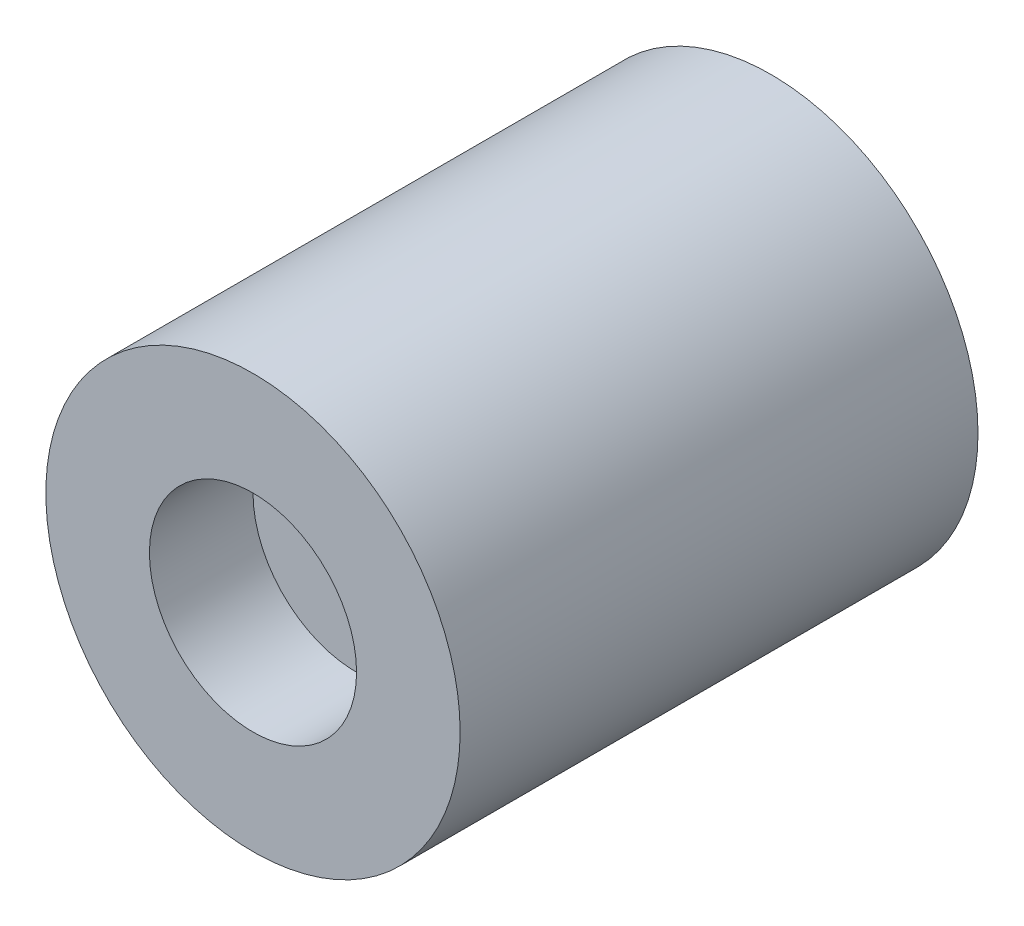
ISO-10303-21;
HEADER;
FILE_DESCRIPTION(('STEP AP214'),'2;1');
FILE_NAME('part.step','',(''),(''),'','','');
FILE_SCHEMA(('AUTOMOTIVE_DESIGN { 1 0 10303 214 1 1 1 1 }'));
ENDSEC;
DATA;
#1=APPLICATION_CONTEXT('core data for automotive mechanical design processes');
#2=APPLICATION_PROTOCOL_DEFINITION('international standard','automotive_design',2000,#1);
#3=PRODUCT_CONTEXT('',#1,'mechanical');
#4=PRODUCT('Part','Part','',(#3));
#5=PRODUCT_RELATED_PRODUCT_CATEGORY('part','',(#4));
#6=PRODUCT_DEFINITION_FORMATION('','',#4);
#7=PRODUCT_DEFINITION_CONTEXT('part definition',#1,'design');
#8=PRODUCT_DEFINITION('design','',#6,#7);
#9=PRODUCT_DEFINITION_SHAPE('','',#8);
#10=(LENGTH_UNIT() NAMED_UNIT(*) SI_UNIT(.MILLI.,.METRE.));
#11=(NAMED_UNIT(*) PLANE_ANGLE_UNIT() SI_UNIT($,.RADIAN.));
#12=(NAMED_UNIT(*) SI_UNIT($,.STERADIAN.) SOLID_ANGLE_UNIT());
#13=UNCERTAINTY_MEASURE_WITH_UNIT(LENGTH_MEASURE(1.E-05),#10,'distance_accuracy_value','');
#14=(GEOMETRIC_REPRESENTATION_CONTEXT(3) GLOBAL_UNCERTAINTY_ASSIGNED_CONTEXT((#13)) GLOBAL_UNIT_ASSIGNED_CONTEXT((#10,
#11,#12)) REPRESENTATION_CONTEXT('',''));
#15=CARTESIAN_POINT('',(0.,0.,0.));
#16=DIRECTION('',(0.,0.,1.));
#17=DIRECTION('',(1.,0.,0.));
#18=AXIS2_PLACEMENT_3D('',#15,#16,#17);
#19=CARTESIAN_POINT('',(0.,0.,25.));
#20=DIRECTION('',(0.,0.,-1.));
#21=DIRECTION('',(-1.,0.,0.));
#22=AXIS2_PLACEMENT_3D('',#19,#20,#21);
#23=CYLINDRICAL_SURFACE('',#22,10.);
#24=CARTESIAN_POINT('',(0.,0.,25.));
#25=DIRECTION('',(0.,0.,1.));
#26=DIRECTION('',(1.,0.,0.));
#27=AXIS2_PLACEMENT_3D('',#24,#25,#26);
#28=CIRCLE('',#27,10.);
#29=CARTESIAN_POINT('',(10.,0.,25.));
#30=VERTEX_POINT('',#29);
#31=EDGE_CURVE('E11',#30,#30,#28,.T.);
#32=ORIENTED_EDGE('',*,*,#31,.F.);
#33=EDGE_LOOP('',(#32));
#34=FACE_BOUND('',#33,.T.);
#35=CARTESIAN_POINT('',(0.,0.,0.));
#36=DIRECTION('',(0.,0.,1.));
#37=DIRECTION('',(1.,0.,0.));
#38=AXIS2_PLACEMENT_3D('',#35,#36,#37);
#39=CIRCLE('',#38,10.);
#40=CARTESIAN_POINT('',(10.,0.,0.));
#41=VERTEX_POINT('',#40);
#42=EDGE_CURVE('E36',#41,#41,#39,.T.);
#43=ORIENTED_EDGE('',*,*,#42,.T.);
#44=EDGE_LOOP('',(#43));
#45=FACE_BOUND('',#44,.T.);
#46=ADVANCED_FACE('F33',(#34,#45),#23,.T.);
#47=CARTESIAN_POINT('',(0.,0.,25.));
#48=DIRECTION('',(0.,0.,1.));
#49=DIRECTION('',(1.,0.,0.));
#50=AXIS2_PLACEMENT_3D('',#47,#48,#49);
#51=PLANE('',#50);
#52=CARTESIAN_POINT('',(0.,0.,25.));
#53=DIRECTION('',(0.,0.,1.));
#54=DIRECTION('',(1.,0.,0.));
#55=AXIS2_PLACEMENT_3D('',#52,#53,#54);
#56=CIRCLE('',#55,5.);
#57=CARTESIAN_POINT('',(5.,0.,25.));
#58=VERTEX_POINT('',#57);
#59=EDGE_CURVE('E52',#58,#58,#56,.T.);
#60=ORIENTED_EDGE('',*,*,#59,.F.);
#61=EDGE_LOOP('',(#60));
#62=FACE_BOUND('',#61,.T.);
#63=ORIENTED_EDGE('',*,*,#31,.T.);
#64=EDGE_LOOP('',(#63));
#65=FACE_BOUND('',#64,.T.);
#66=ADVANCED_FACE('F71',(#62,#65),#51,.T.);
#67=CARTESIAN_POINT('',(0.,0.,0.));
#68=DIRECTION('',(0.,0.,1.));
#69=DIRECTION('',(1.,0.,0.));
#70=AXIS2_PLACEMENT_3D('',#67,#68,#69);
#71=PLANE('',#70);
#72=CARTESIAN_POINT('',(0.,0.,0.));
#73=DIRECTION('',(0.,0.,-1.));
#74=DIRECTION('',(-1.,0.,0.));
#75=AXIS2_PLACEMENT_3D('',#72,#73,#74);
#76=CIRCLE('',#75,2.5);
#77=CARTESIAN_POINT('',(-2.5,0.,0.));
#78=VERTEX_POINT('',#77);
#79=EDGE_CURVE('E53',#78,#78,#76,.T.);
#80=ORIENTED_EDGE('',*,*,#79,.F.);
#81=EDGE_LOOP('',(#80));
#82=FACE_BOUND('',#81,.T.);
#83=ORIENTED_EDGE('',*,*,#42,.F.);
#84=EDGE_LOOP('',(#83));
#85=FACE_BOUND('',#84,.T.);
#86=ADVANCED_FACE('F68',(#82,#85),#71,.F.);
#87=CARTESIAN_POINT('',(0.,0.,20.));
#88=DIRECTION('',(0.,0.,1.));
#89=DIRECTION('',(1.,0.,0.));
#90=AXIS2_PLACEMENT_3D('',#87,#88,#89);
#91=CYLINDRICAL_SURFACE('',#90,5.);
#92=CARTESIAN_POINT('',(0.,0.,20.));
#93=DIRECTION('',(0.,0.,1.));
#94=DIRECTION('',(1.,0.,0.));
#95=AXIS2_PLACEMENT_3D('',#92,#93,#94);
#96=CIRCLE('',#95,5.);
#97=CARTESIAN_POINT('',(5.,0.,20.));
#98=VERTEX_POINT('',#97);
#99=EDGE_CURVE('E56',#98,#98,#96,.T.);
#100=ORIENTED_EDGE('',*,*,#99,.F.);
#101=EDGE_LOOP('',(#100));
#102=FACE_BOUND('',#101,.T.);
#103=ORIENTED_EDGE('',*,*,#59,.T.);
#104=EDGE_LOOP('',(#103));
#105=FACE_BOUND('',#104,.T.);
#106=ADVANCED_FACE('F70',(#102,#105),#91,.F.);
#107=CARTESIAN_POINT('',(0.,0.,20.));
#108=DIRECTION('',(0.,0.,1.));
#109=DIRECTION('',(1.,0.,0.));
#110=AXIS2_PLACEMENT_3D('',#107,#108,#109);
#111=PLANE('',#110);
#112=ORIENTED_EDGE('',*,*,#99,.T.);
#113=EDGE_LOOP('',(#112));
#114=FACE_BOUND('',#113,.T.);
#115=ADVANCED_FACE('F46',(#114),#111,.T.);
#116=CARTESIAN_POINT('',(0.,0.,15.));
#117=DIRECTION('',(0.,0.,-1.));
#118=DIRECTION('',(-1.,0.,0.));
#119=AXIS2_PLACEMENT_3D('',#116,#117,#118);
#120=CONICAL_SURFACE('',#119,2.5,1.02974425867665);
#121=CARTESIAN_POINT('',(0.,0.,16.5021515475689));
#122=VERTEX_POINT('',#121);
#123=VERTEX_LOOP('',#122);
#124=FACE_BOUND('',#123,.T.);
#125=CARTESIAN_POINT('',(0.,0.,15.));
#126=DIRECTION('',(0.,0.,-1.));
#127=DIRECTION('',(-1.,0.,0.));
#128=AXIS2_PLACEMENT_3D('',#125,#126,#127);
#129=CIRCLE('',#128,2.5);
#130=CARTESIAN_POINT('',(-2.5,0.,15.));
#131=VERTEX_POINT('',#130);
#132=EDGE_CURVE('E50',#131,#131,#129,.T.);
#133=ORIENTED_EDGE('',*,*,#132,.T.);
#134=EDGE_LOOP('',(#133));
#135=FACE_BOUND('',#134,.T.);
#136=ADVANCED_FACE('F42',(#124,#135),#120,.F.);
#137=CARTESIAN_POINT('',(0.,0.,0.));
#138=DIRECTION('',(0.,0.,-1.));
#139=DIRECTION('',(-1.,0.,0.));
#140=AXIS2_PLACEMENT_3D('',#137,#138,#139);
#141=CYLINDRICAL_SURFACE('',#140,2.5);
#142=ORIENTED_EDGE('',*,*,#132,.F.);
#143=EDGE_LOOP('',(#142));
#144=FACE_BOUND('',#143,.T.);
#145=ORIENTED_EDGE('',*,*,#79,.T.);
#146=EDGE_LOOP('',(#145));
#147=FACE_BOUND('',#146,.T.);
#148=ADVANCED_FACE('F45',(#144,#147),#141,.F.);
#149=CLOSED_SHELL('',(#46,#66,#86,#106,#115,#136,#148));
#150=MANIFOLD_SOLID_BREP('B2',#149);
#151=ADVANCED_BREP_SHAPE_REPRESENTATION('',(#18,#150),#14);
#152=SHAPE_DEFINITION_REPRESENTATION(#9,#151);
ENDSEC;
END-ISO-10303-21;
